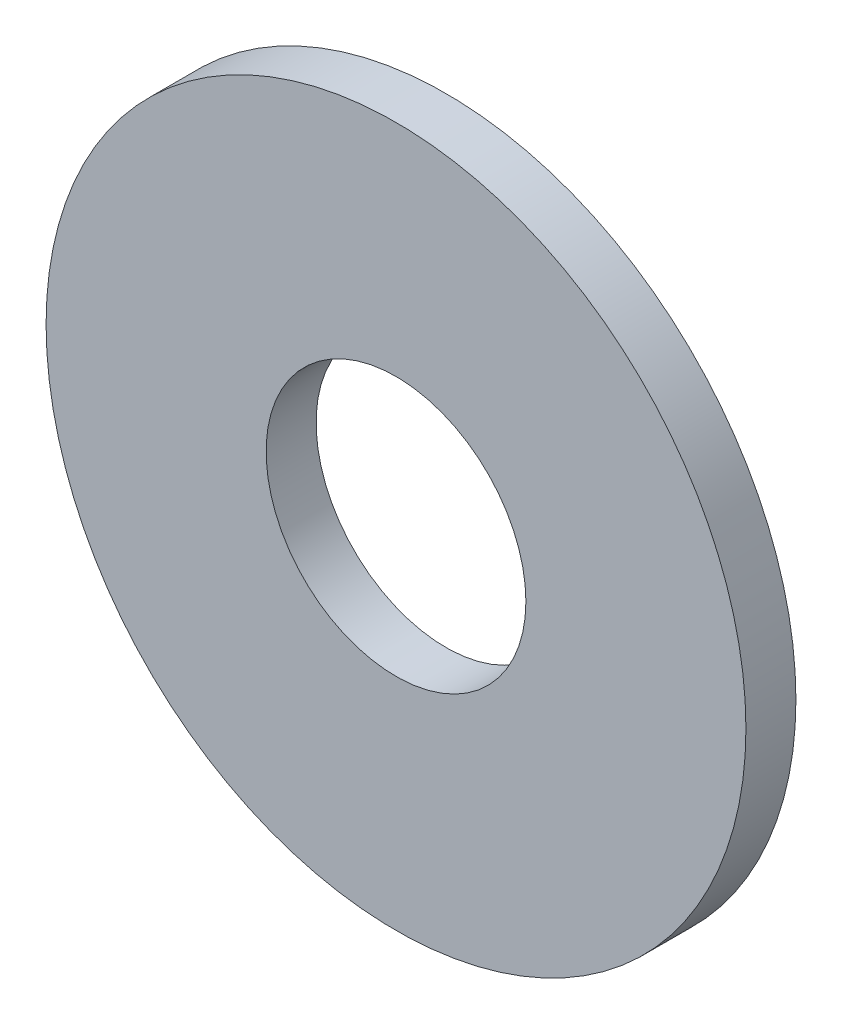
from build123d import *

# Parameters (mm, degrees)
SKETCH1_R           = 8.89
SKETCH1_R_2         = 3.3
BOSS_EXTRUDE1_DEPTH = 1.27


with BuildPart() as part:
    # Sketch1 → Boss-Extrude1 (new body)
    with BuildSketch(Plane.XY):
        with Locations((195.83825512, 4.207637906)):
            Circle(SKETCH1_R)
        with Locations((195.83825512, 4.207637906)):
            Circle(SKETCH1_R_2, mode=Mode.SUBTRACT)
    extrude(amount=BOSS_EXTRUDE1_DEPTH)


solid = part.part
